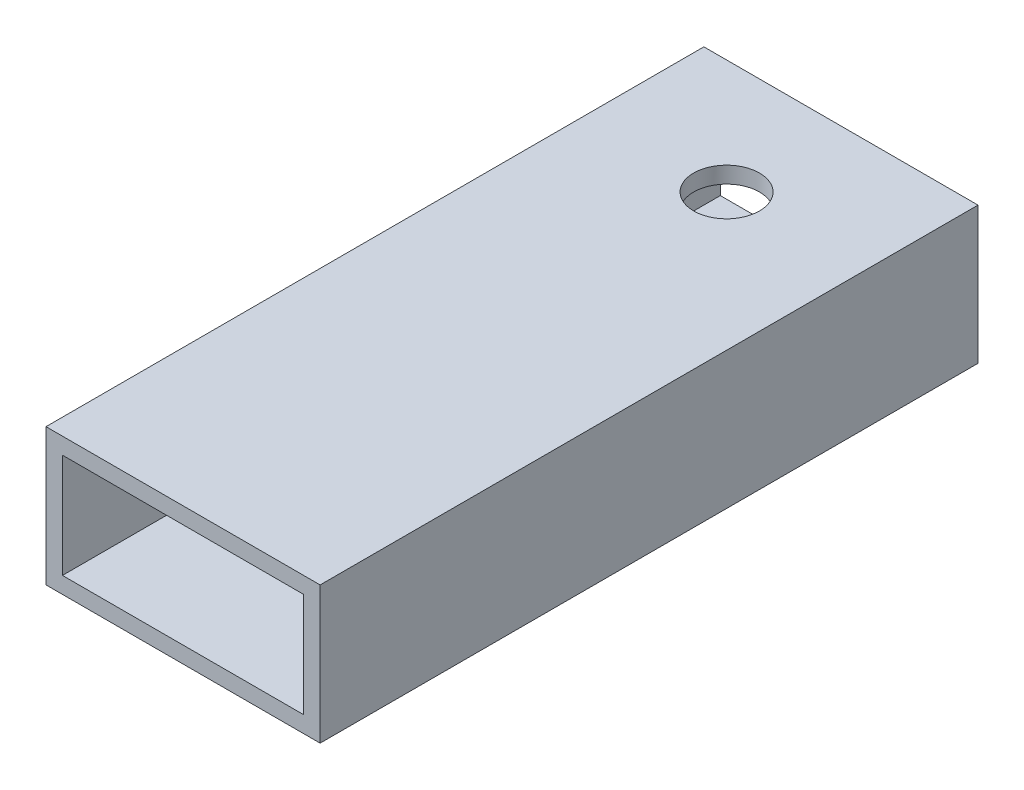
from build123d import *

# Parameters (mm, degrees)
ESQUISSE1_W             = 50
ESQUISSE1_H             = 25
ESQUISSE1_W_2           = 44
ESQUISSE1_H_2           = 19
EXTRUSION1_DEPTH        = 120
ESQUISSE2_R             = 6
ENL_V_MAT_EXTRU_1_DEPTH = 133.382022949


with BuildPart() as part:
    # Esquisse1 → Extrusion1 (new body)
    with BuildSketch(Plane.XY):
        with Locations((25, 12.5)):
            Rectangle(ESQUISSE1_W, ESQUISSE1_H)
        with Locations((25, 12.5)):
            Rectangle(ESQUISSE1_W_2, ESQUISSE1_H_2, mode=Mode.SUBTRACT)
    extrude(amount=EXTRUSION1_DEPTH)

    # Esquisse2 → Enl_v. mat.-Extru.1 (cut, through all)
    with BuildSketch(Plane(origin=(0, 25, 0), x_dir=(-1, 0, 0), z_dir=(0, 1, 0))):
        with Locations(Location((-25, 20.860860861, 0), (0, 0, 90))):
            Circle(ESQUISSE2_R)
    extrude(amount=-ENL_V_MAT_EXTRU_1_DEPTH, mode=Mode.SUBTRACT)


solid = part.part
